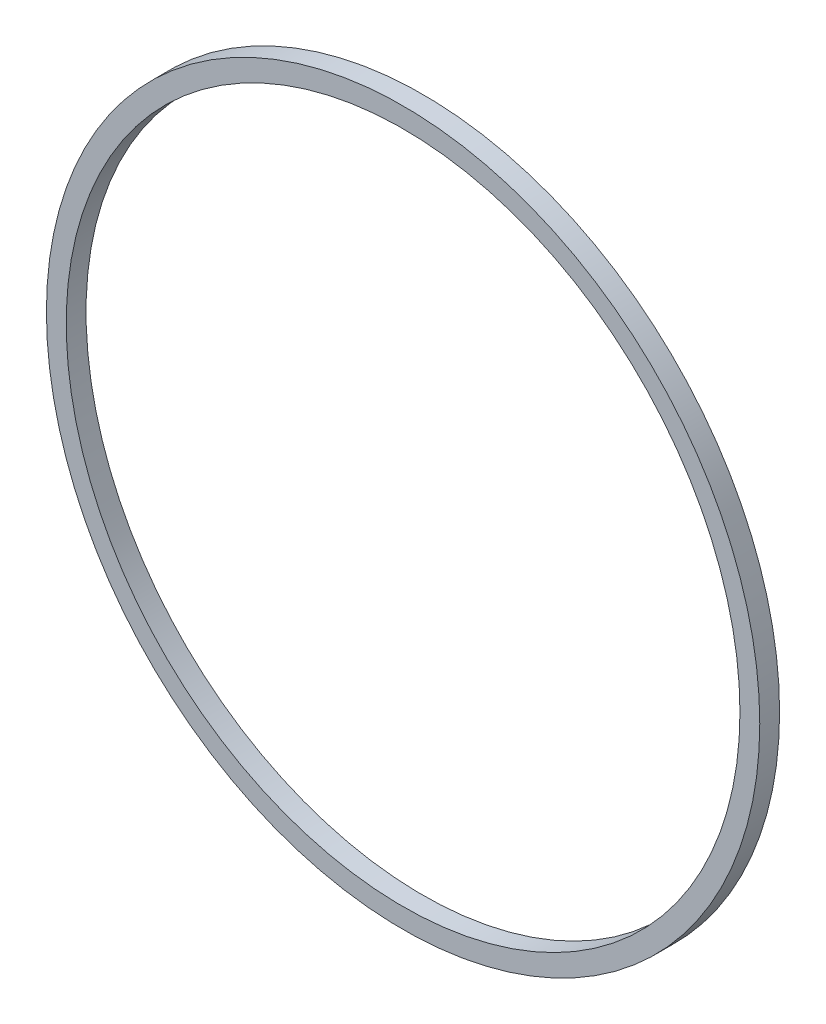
from build123d import *

# Parameters (mm, degrees)
SKETCH_3_W = 2
SKETCH_3_H = 2


with BuildPart() as part:
    # Sketch 3 → Revolve 1 (revolve)
    with BuildSketch(Plane(origin=(0, 0, 0), x_dir=(0, 0, -1), z_dir=(1, 0, 0)), mode=Mode.PRIVATE) as revolve_1_sk:
        with Locations((-1, 35)):
            Rectangle(SKETCH_3_W, SKETCH_3_H)
    revolve(revolve_1_sk.sketch.rotate(Axis((0, 0, 2.465202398), (0, 0, -1)), 90), axis=Axis((0, 0, 2.465202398), (0, 0, -1)))


solid = part.part
